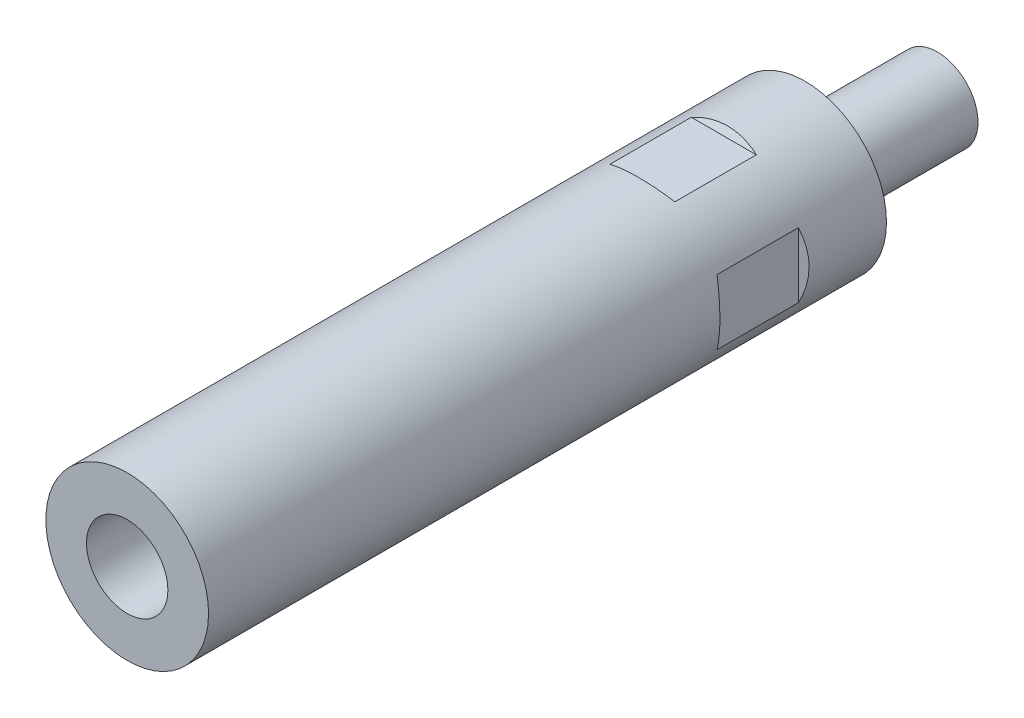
ISO-10303-21;
HEADER;
FILE_DESCRIPTION(('STEP AP214'),'2;1');
FILE_NAME('part.step','',(''),(''),'','','');
FILE_SCHEMA(('AUTOMOTIVE_DESIGN { 1 0 10303 214 1 1 1 1 }'));
ENDSEC;
DATA;
#1=APPLICATION_CONTEXT('core data for automotive mechanical design processes');
#2=APPLICATION_PROTOCOL_DEFINITION('international standard','automotive_design',2000,#1);
#3=PRODUCT_CONTEXT('',#1,'mechanical');
#4=PRODUCT('Part','Part','',(#3));
#5=PRODUCT_RELATED_PRODUCT_CATEGORY('part','',(#4));
#6=PRODUCT_DEFINITION_FORMATION('','',#4);
#7=PRODUCT_DEFINITION_CONTEXT('part definition',#1,'design');
#8=PRODUCT_DEFINITION('design','',#6,#7);
#9=PRODUCT_DEFINITION_SHAPE('','',#8);
#10=(LENGTH_UNIT() NAMED_UNIT(*) SI_UNIT(.MILLI.,.METRE.));
#11=(NAMED_UNIT(*) PLANE_ANGLE_UNIT() SI_UNIT($,.RADIAN.));
#12=(NAMED_UNIT(*) SI_UNIT($,.STERADIAN.) SOLID_ANGLE_UNIT());
#13=UNCERTAINTY_MEASURE_WITH_UNIT(LENGTH_MEASURE(1.E-05),#10,'distance_accuracy_value','');
#14=(GEOMETRIC_REPRESENTATION_CONTEXT(3) GLOBAL_UNCERTAINTY_ASSIGNED_CONTEXT((#13)) GLOBAL_UNIT_ASSIGNED_CONTEXT((#10,
#11,#12)) REPRESENTATION_CONTEXT('',''));
#15=CARTESIAN_POINT('',(0.,0.,0.));
#16=DIRECTION('',(0.,0.,1.));
#17=DIRECTION('',(1.,0.,0.));
#18=AXIS2_PLACEMENT_3D('',#15,#16,#17);
#19=CARTESIAN_POINT('',(0.,0.,0.5));
#20=DIRECTION('',(0.,0.,1.));
#21=DIRECTION('',(0.,-1.,0.));
#22=AXIS2_PLACEMENT_3D('',#19,#20,#21);
#23=CYLINDRICAL_SURFACE('',#22,6.);
#24=CARTESIAN_POINT('',(0.,0.,-19.5));
#25=DIRECTION('',(0.,0.,1.));
#26=DIRECTION('',(0.,-1.,0.));
#27=AXIS2_PLACEMENT_3D('',#24,#25,#26);
#28=CIRCLE('',#27,6.);
#29=CARTESIAN_POINT('',(0.,-6.,-19.5));
#30=VERTEX_POINT('',#29);
#31=EDGE_CURVE('E22',#30,#30,#28,.F.);
#32=ORIENTED_EDGE('',*,*,#31,.F.);
#33=EDGE_LOOP('',(#32));
#34=FACE_BOUND('',#33,.T.);
#35=CARTESIAN_POINT('',(0.,0.,0.));
#36=DIRECTION('',(0.,0.,1.));
#37=DIRECTION('',(1.,0.,0.));
#38=AXIS2_PLACEMENT_3D('',#35,#36,#37);
#39=CIRCLE('',#38,6.);
#40=CARTESIAN_POINT('',(6.,0.,0.));
#41=VERTEX_POINT('',#40);
#42=EDGE_CURVE('E9',#41,#41,#39,.T.);
#43=ORIENTED_EDGE('',*,*,#42,.F.);
#44=EDGE_LOOP('',(#43));
#45=FACE_BOUND('',#44,.T.);
#46=ADVANCED_FACE('F14',(#34,#45),#23,.T.);
#47=CARTESIAN_POINT('',(0.,0.,-19.5));
#48=DIRECTION('',(0.,0.,1.));
#49=DIRECTION('',(0.,-1.,0.));
#50=AXIS2_PLACEMENT_3D('',#47,#48,#49);
#51=PLANE('',#50);
#52=ORIENTED_EDGE('',*,*,#31,.T.);
#53=EDGE_LOOP('',(#52));
#54=FACE_BOUND('',#53,.T.);
#55=ADVANCED_FACE('F16',(#54),#51,.F.);
#56=CARTESIAN_POINT('',(5.1,0.,70.));
#57=DIRECTION('',(0.,0.,-1.));
#58=DIRECTION('',(-1.,0.,0.));
#59=AXIS2_PLACEMENT_3D('',#56,#57,#58);
#60=PLANE('',#59);
#61=CARTESIAN_POINT('',(0.,0.,70.));
#62=DIRECTION('',(0.,0.,1.));
#63=DIRECTION('',(1.,0.,0.));
#64=AXIS2_PLACEMENT_3D('',#61,#62,#63);
#65=CIRCLE('',#64,6.);
#66=CARTESIAN_POINT('',(6.,0.,70.));
#67=VERTEX_POINT('',#66);
#68=EDGE_CURVE('E251',#67,#67,#65,.T.);
#69=ORIENTED_EDGE('',*,*,#68,.T.);
#70=EDGE_LOOP('',(#69));
#71=FACE_BOUND('',#70,.T.);
#72=ADVANCED_FACE('F125',(#71),#60,.F.);
#73=CARTESIAN_POINT('',(0.,0.,100.));
#74=DIRECTION('',(0.,0.,1.));
#75=DIRECTION('',(1.,0.,0.));
#76=AXIS2_PLACEMENT_3D('',#73,#74,#75);
#77=CYLINDRICAL_SURFACE('',#76,6.);
#78=ORIENTED_EDGE('',*,*,#68,.F.);
#79=EDGE_LOOP('',(#78));
#80=FACE_BOUND('',#79,.T.);
#81=CARTESIAN_POINT('',(0.,0.,100.));
#82=DIRECTION('',(0.,0.,1.));
#83=DIRECTION('',(1.,0.,0.));
#84=AXIS2_PLACEMENT_3D('',#81,#82,#83);
#85=CIRCLE('',#84,6.);
#86=CARTESIAN_POINT('',(6.,0.,100.));
#87=VERTEX_POINT('',#86);
#88=EDGE_CURVE('E96',#87,#87,#85,.T.);
#89=ORIENTED_EDGE('',*,*,#88,.T.);
#90=EDGE_LOOP('',(#89));
#91=FACE_BOUND('',#90,.T.);
#92=ADVANCED_FACE('F127',(#80,#91),#77,.F.);
#93=CARTESIAN_POINT('',(0.,0.,100.));
#94=DIRECTION('',(0.,0.,1.));
#95=DIRECTION('',(1.,0.,0.));
#96=AXIS2_PLACEMENT_3D('',#93,#94,#95);
#97=PLANE('',#96);
#98=ORIENTED_EDGE('',*,*,#88,.F.);
#99=EDGE_LOOP('',(#98));
#100=FACE_BOUND('',#99,.T.);
#101=CARTESIAN_POINT('',(0.,0.,100.));
#102=DIRECTION('',(0.,0.,1.));
#103=DIRECTION('',(1.,0.,0.));
#104=AXIS2_PLACEMENT_3D('',#101,#102,#103);
#105=CIRCLE('',#104,12.);
#106=CARTESIAN_POINT('',(12.,0.,100.));
#107=VERTEX_POINT('',#106);
#108=EDGE_CURVE('E239',#107,#107,#105,.T.);
#109=ORIENTED_EDGE('',*,*,#108,.T.);
#110=EDGE_LOOP('',(#109));
#111=FACE_BOUND('',#110,.T.);
#112=ADVANCED_FACE('F134',(#100,#111),#97,.T.);
#113=CARTESIAN_POINT('',(11.,-12.,24.));
#114=DIRECTION('',(-0.5,0.,0.866025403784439));
#115=DIRECTION('',(0.866025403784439,0.,0.5));
#116=AXIS2_PLACEMENT_3D('',#113,#114,#115);
#117=PLANE('',#116);
#118=DIRECTION('',(0.,1.,0.));
#119=VECTOR('',#118,1.);
#120=CARTESIAN_POINT('',(11.,-12.,24.));
#121=LINE('',#120,#119);
#122=CARTESIAN_POINT('',(11.,-4.79583152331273,24.));
#123=VERTEX_POINT('',#122);
#124=CARTESIAN_POINT('',(11.,4.79583152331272,24.));
#125=VERTEX_POINT('',#124);
#126=EDGE_CURVE('E183',#123,#125,#121,.T.);
#127=ORIENTED_EDGE('',*,*,#126,.T.);
#128=CARTESIAN_POINT('',(0.,0.,17.6491470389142));
#129=DIRECTION('',(-0.5,0.,0.866025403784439));
#130=DIRECTION('',(-0.866025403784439,0.,-0.5));
#131=AXIS2_PLACEMENT_3D('',#128,#129,#130);
#132=ELLIPSE('',#131,13.856406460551,12.);
#133=EDGE_CURVE('E35',#123,#125,#132,.T.);
#134=ORIENTED_EDGE('',*,*,#133,.F.);
#135=EDGE_LOOP('',(#127,#134));
#136=FACE_BOUND('',#135,.T.);
#137=ADVANCED_FACE('F175',(#136),#117,.F.);
#138=CARTESIAN_POINT('',(11.,-12.,24.));
#139=DIRECTION('',(-1.,0.,0.));
#140=DIRECTION('',(0.,0.,1.));
#141=AXIS2_PLACEMENT_3D('',#138,#139,#140);
#142=PLANE('',#141);
#143=ORIENTED_EDGE('',*,*,#126,.F.);
#144=DIRECTION('',(0.,0.,-1.));
#145=VECTOR('',#144,1.);
#146=CARTESIAN_POINT('',(11.,-4.79583152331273,100.));
#147=LINE('',#146,#145);
#148=CARTESIAN_POINT('',(11.,-4.79583152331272,12.));
#149=VERTEX_POINT('',#148);
#150=EDGE_CURVE('E191',#149,#123,#147,.F.);
#151=ORIENTED_EDGE('',*,*,#150,.F.);
#152=DIRECTION('',(0.,1.,0.));
#153=VECTOR('',#152,1.);
#154=CARTESIAN_POINT('',(11.,-12.,12.));
#155=LINE('',#154,#153);
#156=CARTESIAN_POINT('',(11.,4.7958315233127,12.));
#157=VERTEX_POINT('',#156);
#158=EDGE_CURVE('E187',#149,#157,#155,.T.);
#159=ORIENTED_EDGE('',*,*,#158,.T.);
#160=DIRECTION('',(0.,0.,-1.));
#161=VECTOR('',#160,1.);
#162=CARTESIAN_POINT('',(11.,4.79583152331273,100.));
#163=LINE('',#162,#161);
#164=EDGE_CURVE('E29',#125,#157,#163,.T.);
#165=ORIENTED_EDGE('',*,*,#164,.F.);
#166=EDGE_LOOP('',(#143,#151,#159,#165));
#167=FACE_BOUND('',#166,.T.);
#168=ADVANCED_FACE('F172',(#167),#142,.F.);
#169=CARTESIAN_POINT('',(11.,-12.,12.));
#170=DIRECTION('',(-0.5,0.,-0.866025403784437));
#171=DIRECTION('',(-0.866025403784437,0.,0.5));
#172=AXIS2_PLACEMENT_3D('',#169,#170,#171);
#173=PLANE('',#172);
#174=CARTESIAN_POINT('',(0.,0.,18.350852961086));
#175=DIRECTION('',(-0.5,0.,-0.866025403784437));
#176=DIRECTION('',(0.866025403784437,0.,-0.5));
#177=AXIS2_PLACEMENT_3D('',#174,#175,#176);
#178=ELLIPSE('',#177,13.856406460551,12.);
#179=EDGE_CURVE('E195',#157,#149,#178,.T.);
#180=ORIENTED_EDGE('',*,*,#179,.F.);
#181=ORIENTED_EDGE('',*,*,#158,.F.);
#182=EDGE_LOOP('',(#180,#181));
#183=FACE_BOUND('',#182,.T.);
#184=ADVANCED_FACE('F167',(#183),#173,.F.);
#185=CARTESIAN_POINT('',(-11.,-12.,12.));
#186=DIRECTION('',(0.5,0.,-0.866025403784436));
#187=DIRECTION('',(-0.866025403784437,0.,-0.5));
#188=AXIS2_PLACEMENT_3D('',#185,#186,#187);
#189=PLANE('',#188);
#190=CARTESIAN_POINT('',(0.,0.,18.350852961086));
#191=DIRECTION('',(0.5,0.,-0.866025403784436));
#192=DIRECTION('',(-0.866025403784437,0.,-0.5));
#193=AXIS2_PLACEMENT_3D('',#190,#191,#192);
#194=ELLIPSE('',#193,13.8564064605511,12.);
#195=CARTESIAN_POINT('',(-11.,-4.79583152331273,12.));
#196=VERTEX_POINT('',#195);
#197=CARTESIAN_POINT('',(-11.,4.79583152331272,12.));
#198=VERTEX_POINT('',#197);
#199=EDGE_CURVE('E193',#196,#198,#194,.T.);
#200=ORIENTED_EDGE('',*,*,#199,.F.);
#201=DIRECTION('',(0.,1.,0.));
#202=VECTOR('',#201,1.);
#203=CARTESIAN_POINT('',(-11.,-12.,12.));
#204=LINE('',#203,#202);
#205=EDGE_CURVE('E227',#196,#198,#204,.T.);
#206=ORIENTED_EDGE('',*,*,#205,.T.);
#207=EDGE_LOOP('',(#200,#206));
#208=FACE_BOUND('',#207,.T.);
#209=ADVANCED_FACE('F163',(#208),#189,.F.);
#210=CARTESIAN_POINT('',(-11.,-12.,24.));
#211=DIRECTION('',(0.5,0.,0.866025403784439));
#212=DIRECTION('',(0.866025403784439,0.,-0.5));
#213=AXIS2_PLACEMENT_3D('',#210,#211,#212);
#214=PLANE('',#213);
#215=DIRECTION('',(0.,1.,0.));
#216=VECTOR('',#215,1.);
#217=CARTESIAN_POINT('',(-11.,-12.,24.));
#218=LINE('',#217,#216);
#219=CARTESIAN_POINT('',(-11.,-4.79583152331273,24.));
#220=VERTEX_POINT('',#219);
#221=CARTESIAN_POINT('',(-11.,4.79583152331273,24.));
#222=VERTEX_POINT('',#221);
#223=EDGE_CURVE('E231',#220,#222,#218,.T.);
#224=ORIENTED_EDGE('',*,*,#223,.F.);
#225=CARTESIAN_POINT('',(0.,0.,17.6491470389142));
#226=DIRECTION('',(0.5,0.,0.866025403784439));
#227=DIRECTION('',(0.866025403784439,0.,-0.5));
#228=AXIS2_PLACEMENT_3D('',#225,#226,#227);
#229=ELLIPSE('',#228,13.856406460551,12.);
#230=EDGE_CURVE('E206',#222,#220,#229,.T.);
#231=ORIENTED_EDGE('',*,*,#230,.F.);
#232=EDGE_LOOP('',(#224,#231));
#233=FACE_BOUND('',#232,.T.);
#234=ADVANCED_FACE('F160',(#233),#214,.F.);
#235=CARTESIAN_POINT('',(-11.,-12.,24.));
#236=DIRECTION('',(1.,0.,0.));
#237=DIRECTION('',(0.,0.,-1.));
#238=AXIS2_PLACEMENT_3D('',#235,#236,#237);
#239=PLANE('',#238);
#240=ORIENTED_EDGE('',*,*,#223,.T.);
#241=DIRECTION('',(0.,0.,-1.));
#242=VECTOR('',#241,1.);
#243=CARTESIAN_POINT('',(-11.,4.79583152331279,100.));
#244=LINE('',#243,#242);
#245=EDGE_CURVE('E200',#198,#222,#244,.F.);
#246=ORIENTED_EDGE('',*,*,#245,.F.);
#247=ORIENTED_EDGE('',*,*,#205,.F.);
#248=DIRECTION('',(0.,0.,-1.));
#249=VECTOR('',#248,1.);
#250=CARTESIAN_POINT('',(-11.,-4.79583152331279,100.));
#251=LINE('',#250,#249);
#252=EDGE_CURVE('E203',#220,#196,#251,.T.);
#253=ORIENTED_EDGE('',*,*,#252,.F.);
#254=EDGE_LOOP('',(#240,#246,#247,#253));
#255=FACE_BOUND('',#254,.T.);
#256=ADVANCED_FACE('F158',(#255),#239,.F.);
#257=CARTESIAN_POINT('',(12.,11.,24.));
#258=DIRECTION('',(0.,-0.5,0.866025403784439));
#259=DIRECTION('',(0.,-0.866025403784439,-0.5));
#260=AXIS2_PLACEMENT_3D('',#257,#258,#259);
#261=PLANE('',#260);
#262=DIRECTION('',(-1.,0.,0.));
#263=VECTOR('',#262,1.);
#264=CARTESIAN_POINT('',(12.,11.,24.));
#265=LINE('',#264,#263);
#266=CARTESIAN_POINT('',(4.79583152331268,11.,24.));
#267=VERTEX_POINT('',#266);
#268=CARTESIAN_POINT('',(-4.79583152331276,11.,24.));
#269=VERTEX_POINT('',#268);
#270=EDGE_CURVE('E225',#267,#269,#265,.T.);
#271=ORIENTED_EDGE('',*,*,#270,.T.);
#272=CARTESIAN_POINT('',(0.,0.,17.6491470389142));
#273=DIRECTION('',(0.,-0.5,0.866025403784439));
#274=DIRECTION('',(0.,-0.866025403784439,-0.5));
#275=AXIS2_PLACEMENT_3D('',#272,#273,#274);
#276=ELLIPSE('',#275,13.856406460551,12.);
#277=EDGE_CURVE('E214',#267,#269,#276,.T.);
#278=ORIENTED_EDGE('',*,*,#277,.F.);
#279=EDGE_LOOP('',(#271,#278));
#280=FACE_BOUND('',#279,.T.);
#281=ADVANCED_FACE('F151',(#280),#261,.F.);
#282=CARTESIAN_POINT('',(12.,11.,24.));
#283=DIRECTION('',(0.,-1.,0.));
#284=DIRECTION('',(1.,0.,0.));
#285=AXIS2_PLACEMENT_3D('',#282,#283,#284);
#286=PLANE('',#285);
#287=ORIENTED_EDGE('',*,*,#270,.F.);
#288=DIRECTION('',(0.,0.,-1.));
#289=VECTOR('',#288,1.);
#290=CARTESIAN_POINT('',(4.79583152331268,11.,100.));
#291=LINE('',#290,#289);
#292=CARTESIAN_POINT('',(4.79583152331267,11.,12.));
#293=VERTEX_POINT('',#292);
#294=EDGE_CURVE('E88',#293,#267,#291,.F.);
#295=ORIENTED_EDGE('',*,*,#294,.F.);
#296=DIRECTION('',(-1.,0.,0.));
#297=VECTOR('',#296,1.);
#298=CARTESIAN_POINT('',(12.,11.,12.));
#299=LINE('',#298,#297);
#300=CARTESIAN_POINT('',(-4.79583152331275,11.,12.));
#301=VERTEX_POINT('',#300);
#302=EDGE_CURVE('E223',#293,#301,#299,.T.);
#303=ORIENTED_EDGE('',*,*,#302,.T.);
#304=DIRECTION('',(0.,0.,-1.));
#305=VECTOR('',#304,1.);
#306=CARTESIAN_POINT('',(-4.79583152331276,11.,100.));
#307=LINE('',#306,#305);
#308=EDGE_CURVE('E211',#269,#301,#307,.T.);
#309=ORIENTED_EDGE('',*,*,#308,.F.);
#310=EDGE_LOOP('',(#287,#295,#303,#309));
#311=FACE_BOUND('',#310,.T.);
#312=ADVANCED_FACE('F148',(#311),#286,.F.);
#313=CARTESIAN_POINT('',(12.,11.,12.));
#314=DIRECTION('',(0.,-0.5,-0.866025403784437));
#315=DIRECTION('',(0.,0.866025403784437,-0.5));
#316=AXIS2_PLACEMENT_3D('',#313,#314,#315);
#317=PLANE('',#316);
#318=CARTESIAN_POINT('',(0.,0.,18.350852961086));
#319=DIRECTION('',(0.,-0.5,-0.866025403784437));
#320=DIRECTION('',(0.,0.866025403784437,-0.5));
#321=AXIS2_PLACEMENT_3D('',#318,#319,#320);
#322=ELLIPSE('',#321,13.856406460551,12.);
#323=EDGE_CURVE('E209',#301,#293,#322,.T.);
#324=ORIENTED_EDGE('',*,*,#323,.F.);
#325=ORIENTED_EDGE('',*,*,#302,.F.);
#326=EDGE_LOOP('',(#324,#325));
#327=FACE_BOUND('',#326,.T.);
#328=ADVANCED_FACE('F145',(#327),#317,.F.);
#329=CARTESIAN_POINT('',(12.,-11.,12.));
#330=DIRECTION('',(0.,0.5,-0.866025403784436));
#331=DIRECTION('',(0.,0.866025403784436,0.5));
#332=AXIS2_PLACEMENT_3D('',#329,#330,#331);
#333=PLANE('',#332);
#334=CARTESIAN_POINT('',(0.,0.,18.350852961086));
#335=DIRECTION('',(0.,0.5,-0.866025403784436));
#336=DIRECTION('',(0.,-0.866025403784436,-0.5));
#337=AXIS2_PLACEMENT_3D('',#334,#335,#336);
#338=ELLIPSE('',#337,13.8564064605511,12.);
#339=CARTESIAN_POINT('',(4.79583152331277,-11.,12.));
#340=VERTEX_POINT('',#339);
#341=CARTESIAN_POINT('',(-4.79583152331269,-11.,12.));
#342=VERTEX_POINT('',#341);
#343=EDGE_CURVE('E79',#340,#342,#338,.T.);
#344=ORIENTED_EDGE('',*,*,#343,.F.);
#345=DIRECTION('',(-1.,0.,0.));
#346=VECTOR('',#345,1.);
#347=CARTESIAN_POINT('',(12.,-11.,12.));
#348=LINE('',#347,#346);
#349=EDGE_CURVE('E82',#340,#342,#348,.T.);
#350=ORIENTED_EDGE('',*,*,#349,.T.);
#351=EDGE_LOOP('',(#344,#350));
#352=FACE_BOUND('',#351,.T.);
#353=ADVANCED_FACE('F81',(#352),#333,.F.);
#354=CARTESIAN_POINT('',(12.,-11.,24.));
#355=DIRECTION('',(0.,0.5,0.866025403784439));
#356=DIRECTION('',(0.,-0.866025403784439,0.5));
#357=AXIS2_PLACEMENT_3D('',#354,#355,#356);
#358=PLANE('',#357);
#359=DIRECTION('',(-1.,0.,0.));
#360=VECTOR('',#359,1.);
#361=CARTESIAN_POINT('',(12.,-11.,24.));
#362=LINE('',#361,#360);
#363=CARTESIAN_POINT('',(4.79583152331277,-11.,24.));
#364=VERTEX_POINT('',#363);
#365=CARTESIAN_POINT('',(-4.79583152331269,-11.,24.));
#366=VERTEX_POINT('',#365);
#367=EDGE_CURVE('E95',#364,#366,#362,.T.);
#368=ORIENTED_EDGE('',*,*,#367,.F.);
#369=CARTESIAN_POINT('',(0.,0.,17.6491470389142));
#370=DIRECTION('',(0.,0.5,0.866025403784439));
#371=DIRECTION('',(0.,0.866025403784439,-0.5));
#372=AXIS2_PLACEMENT_3D('',#369,#370,#371);
#373=ELLIPSE('',#372,13.856406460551,12.);
#374=EDGE_CURVE('E101',#366,#364,#373,.T.);
#375=ORIENTED_EDGE('',*,*,#374,.F.);
#376=EDGE_LOOP('',(#368,#375));
#377=FACE_BOUND('',#376,.T.);
#378=ADVANCED_FACE('F139',(#377),#358,.F.);
#379=CARTESIAN_POINT('',(12.,-11.,24.));
#380=DIRECTION('',(0.,1.,0.));
#381=DIRECTION('',(-1.,0.,0.));
#382=AXIS2_PLACEMENT_3D('',#379,#380,#381);
#383=PLANE('',#382);
#384=ORIENTED_EDGE('',*,*,#367,.T.);
#385=DIRECTION('',(0.,0.,-1.));
#386=VECTOR('',#385,1.);
#387=CARTESIAN_POINT('',(-4.79583152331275,-11.,100.));
#388=LINE('',#387,#386);
#389=EDGE_CURVE('E87',#342,#366,#388,.F.);
#390=ORIENTED_EDGE('',*,*,#389,.F.);
#391=ORIENTED_EDGE('',*,*,#349,.F.);
#392=DIRECTION('',(0.,0.,-1.));
#393=VECTOR('',#392,1.);
#394=CARTESIAN_POINT('',(4.79583152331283,-11.,100.));
#395=LINE('',#394,#393);
#396=EDGE_CURVE('E93',#364,#340,#395,.T.);
#397=ORIENTED_EDGE('',*,*,#396,.F.);
#398=EDGE_LOOP('',(#384,#390,#391,#397));
#399=FACE_BOUND('',#398,.T.);
#400=ADVANCED_FACE('F92',(#399),#383,.F.);
#401=CARTESIAN_POINT('',(0.,0.,100.));
#402=DIRECTION('',(0.,0.,-1.));
#403=DIRECTION('',(-1.,0.,0.));
#404=AXIS2_PLACEMENT_3D('',#401,#402,#403);
#405=CYLINDRICAL_SURFACE('',#404,12.);
#406=ORIENTED_EDGE('',*,*,#389,.T.);
#407=ORIENTED_EDGE('',*,*,#374,.T.);
#408=ORIENTED_EDGE('',*,*,#396,.T.);
#409=ORIENTED_EDGE('',*,*,#343,.T.);
#410=EDGE_LOOP('',(#406,#407,#408,#409));
#411=FACE_BOUND('',#410,.T.);
#412=ORIENTED_EDGE('',*,*,#323,.T.);
#413=ORIENTED_EDGE('',*,*,#294,.T.);
#414=ORIENTED_EDGE('',*,*,#277,.T.);
#415=ORIENTED_EDGE('',*,*,#308,.T.);
#416=EDGE_LOOP('',(#412,#413,#414,#415));
#417=FACE_BOUND('',#416,.T.);
#418=ORIENTED_EDGE('',*,*,#245,.T.);
#419=ORIENTED_EDGE('',*,*,#230,.T.);
#420=ORIENTED_EDGE('',*,*,#252,.T.);
#421=ORIENTED_EDGE('',*,*,#199,.T.);
#422=EDGE_LOOP('',(#418,#419,#420,#421));
#423=FACE_BOUND('',#422,.T.);
#424=ORIENTED_EDGE('',*,*,#179,.T.);
#425=ORIENTED_EDGE('',*,*,#150,.T.);
#426=ORIENTED_EDGE('',*,*,#133,.T.);
#427=ORIENTED_EDGE('',*,*,#164,.T.);
#428=EDGE_LOOP('',(#424,#425,#426,#427));
#429=FACE_BOUND('',#428,.T.);
#430=ORIENTED_EDGE('',*,*,#108,.F.);
#431=EDGE_LOOP('',(#430));
#432=FACE_BOUND('',#431,.T.);
#433=CARTESIAN_POINT('',(0.,0.,0.));
#434=DIRECTION('',(0.,0.,1.));
#435=DIRECTION('',(1.,0.,0.));
#436=AXIS2_PLACEMENT_3D('',#433,#434,#435);
#437=CIRCLE('',#436,12.);
#438=CARTESIAN_POINT('',(12.,0.,0.));
#439=VERTEX_POINT('',#438);
#440=EDGE_CURVE('E186',#439,#439,#437,.T.);
#441=ORIENTED_EDGE('',*,*,#440,.T.);
#442=EDGE_LOOP('',(#441));
#443=FACE_BOUND('',#442,.T.);
#444=ADVANCED_FACE('F99',(#411,#417,#423,#429,#432,#443),#405,.T.);
#445=CARTESIAN_POINT('',(0.,0.,0.));
#446=DIRECTION('',(0.,0.,1.));
#447=DIRECTION('',(1.,0.,0.));
#448=AXIS2_PLACEMENT_3D('',#445,#446,#447);
#449=PLANE('',#448);
#450=ORIENTED_EDGE('',*,*,#440,.F.);
#451=EDGE_LOOP('',(#450));
#452=FACE_BOUND('',#451,.T.);
#453=ORIENTED_EDGE('',*,*,#42,.T.);
#454=EDGE_LOOP('',(#453));
#455=FACE_BOUND('',#454,.T.);
#456=ADVANCED_FACE('F111',(#452,#455),#449,.F.);
#457=CLOSED_SHELL('',(#46,#55,#72,#92,#112,#137,#168,#184,#209,#234,#256,#281,#312,#328,#353,
#378,#400,#444,#456));
#458=MANIFOLD_SOLID_BREP('B1',#457);
#459=ADVANCED_BREP_SHAPE_REPRESENTATION('',(#18,#458),#14);
#460=SHAPE_DEFINITION_REPRESENTATION(#9,#459);
ENDSEC;
END-ISO-10303-21;
